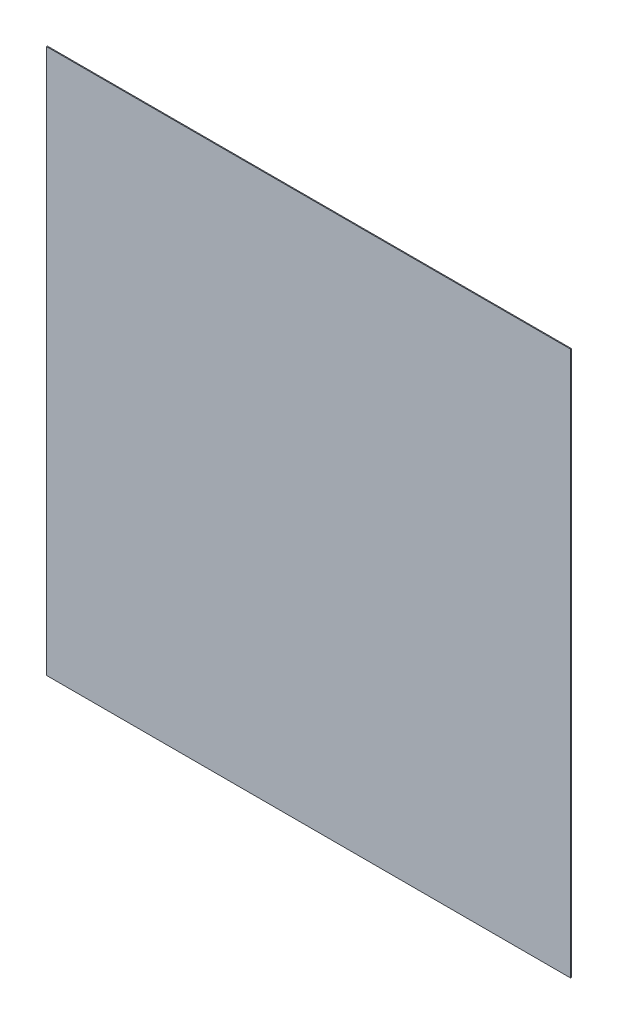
from build123d import *

# Parameters (mm, degrees)
ESQUISSE1_W        = 2300
ESQUISSE1_H        = 2390
BOSS_EXTRU_1_DEPTH = 4


with BuildPart() as part:
    # Esquisse1 → Boss.-Extru.1 (new body)
    with BuildSketch(Plane.XY):
        with Locations((1150, 1195)):
            Rectangle(ESQUISSE1_W, ESQUISSE1_H)
    extrude(amount=BOSS_EXTRU_1_DEPTH)


solid = part.part
